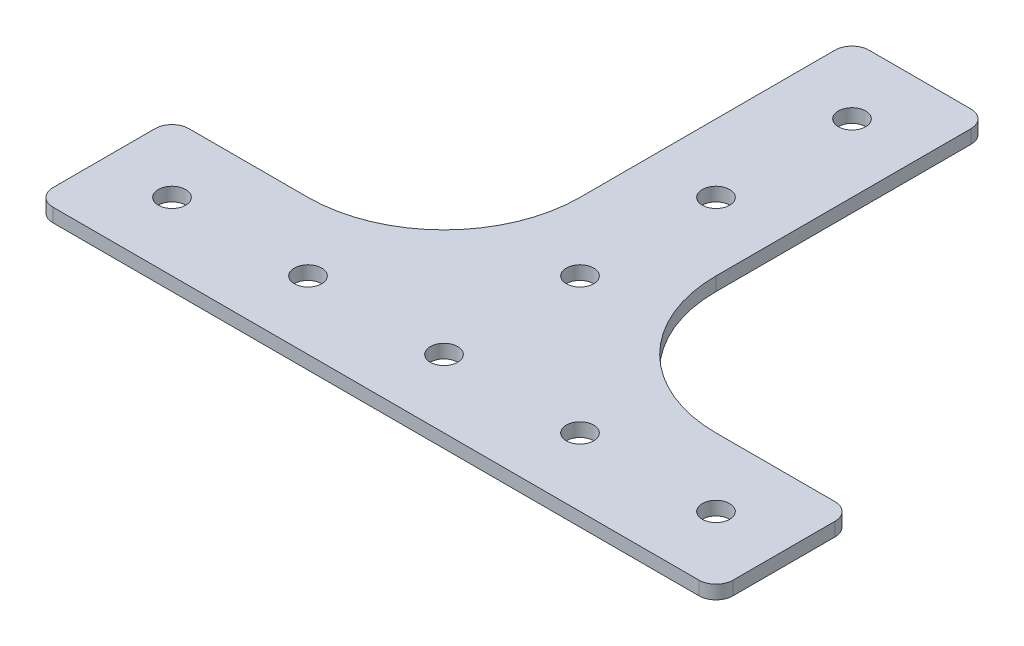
from build123d import *

# Parameters (mm, degrees)
BOSS_EXTRUDE1_DEPTH        = 2.54
FILLET1_R                  = 3.175
F_7_0_201_DIAMETER_HOLE1_D = 5.1054
FILLET2_R                  = 25.4


with BuildPart() as part:
    # Sketch1 → Boss-Extrude1 (new body)
    with BuildSketch(Plane(origin=(0, 0, 0), x_dir=(1, 0, 0), z_dir=(0, 1, 0))):
        Polygon((-63.5, 0), (63.5, 0), (63.5, 25.4), (12.7, 25.4), (12.7, 101.6), (-12.7, 101.6), (-12.7, 25.4), (-63.5, 25.4), align=None)
    extrude(amount=BOSS_EXTRUDE1_DEPTH)

    # Fillet1
    fillet1_edges = [part.edges().sort_by_distance(p)[0] for p in [
        (-12.7, 1.27, -101.6),
        (12.7, 1.27, -101.6),
        (63.5, 1.27, -25.4),
        (63.5, 1.27, 0),
        (-63.5, 1.27, 0),
        (-63.5, 1.27, -25.4),
    ]]
    fillet(fillet1_edges, radius=FILLET1_R)

    # 7 _0.201_ Diameter Hole1 (through all)
    with Locations(Plane(origin=(0, 2.54, 0), x_dir=(1, 0, 0), z_dir=(0, 1, 0))):
        with Locations((0, 12.7), (25.4, 12.7), (50.8, 12.7), (-25.4, 12.7), (-50.8, 12.7), (0, 38.1), (0, 63.5), (0, 88.9)):
            Hole(F_7_0_201_DIAMETER_HOLE1_D / 2)

    # Fillet2
    fillet2_edges = [part.edges().sort_by_distance(p)[0] for p in [
        (12.7, 1.27, -25.4),
        (-12.7, 1.27, -25.4),
    ]]
    fillet(fillet2_edges, radius=FILLET2_R)


solid = part.part
